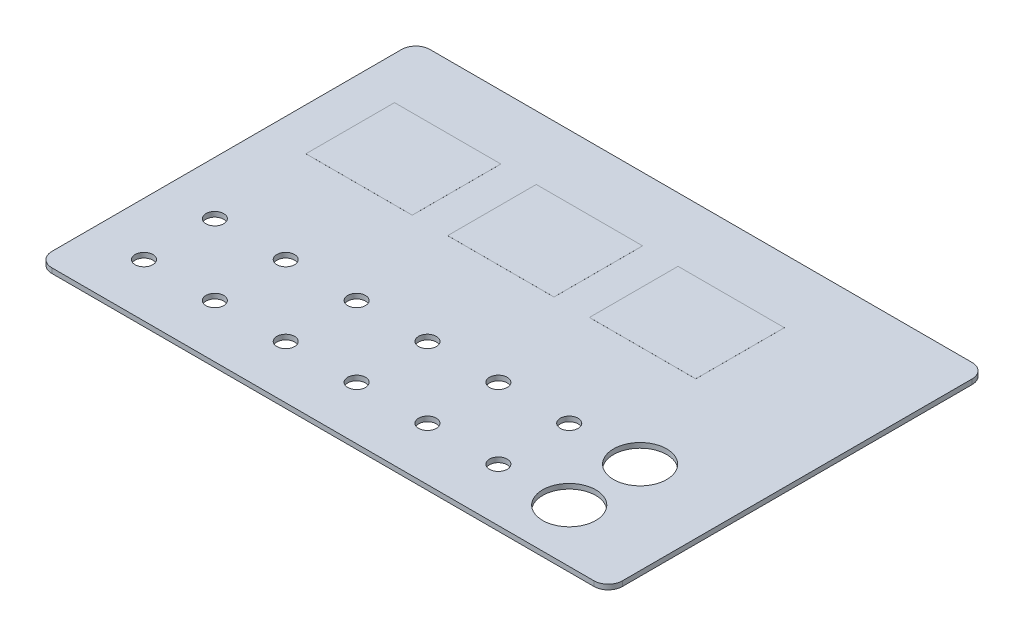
ISO-10303-21;
HEADER;
FILE_DESCRIPTION(('STEP AP214'),'2;1');
FILE_NAME('part.step','',(''),(''),'','','');
FILE_SCHEMA(('AUTOMOTIVE_DESIGN { 1 0 10303 214 1 1 1 1 }'));
ENDSEC;
DATA;
#1=APPLICATION_CONTEXT('core data for automotive mechanical design processes');
#2=APPLICATION_PROTOCOL_DEFINITION('international standard','automotive_design',2000,#1);
#3=PRODUCT_CONTEXT('',#1,'mechanical');
#4=PRODUCT('Part','Part','',(#3));
#5=PRODUCT_RELATED_PRODUCT_CATEGORY('part','',(#4));
#6=PRODUCT_DEFINITION_FORMATION('','',#4);
#7=PRODUCT_DEFINITION_CONTEXT('part definition',#1,'design');
#8=PRODUCT_DEFINITION('design','',#6,#7);
#9=PRODUCT_DEFINITION_SHAPE('','',#8);
#10=(LENGTH_UNIT() NAMED_UNIT(*) SI_UNIT(.MILLI.,.METRE.));
#11=(NAMED_UNIT(*) PLANE_ANGLE_UNIT() SI_UNIT($,.RADIAN.));
#12=(NAMED_UNIT(*) SI_UNIT($,.STERADIAN.) SOLID_ANGLE_UNIT());
#13=UNCERTAINTY_MEASURE_WITH_UNIT(LENGTH_MEASURE(1.E-05),#10,'distance_accuracy_value','');
#14=(GEOMETRIC_REPRESENTATION_CONTEXT(3) GLOBAL_UNCERTAINTY_ASSIGNED_CONTEXT((#13)) GLOBAL_UNIT_ASSIGNED_CONTEXT((#10,
#11,#12)) REPRESENTATION_CONTEXT('',''));
#15=CARTESIAN_POINT('',(0.,0.,0.));
#16=DIRECTION('',(0.,0.,1.));
#17=DIRECTION('',(1.,0.,0.));
#18=AXIS2_PLACEMENT_3D('',#15,#16,#17);
#19=CARTESIAN_POINT('',(0.,1.4,0.));
#20=DIRECTION('',(0.,1.,0.));
#21=DIRECTION('',(0.,0.,1.));
#22=AXIS2_PLACEMENT_3D('',#19,#20,#21);
#23=PLANE('',#22);
#24=DIRECTION('',(1.,0.,0.));
#25=VECTOR('',#24,1.);
#26=CARTESIAN_POINT('',(-22.7057496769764,1.4,-19.48512858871));
#27=LINE('',#26,#25);
#28=CARTESIAN_POINT('',(-22.7057496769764,1.4,-19.48512858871));
#29=VERTEX_POINT('',#28);
#30=CARTESIAN_POINT('',(7.29425032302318,1.4,-19.48512858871));
#31=VERTEX_POINT('',#30);
#32=EDGE_CURVE('E200',#29,#31,#27,.T.);
#33=ORIENTED_EDGE('',*,*,#32,.F.);
#34=DIRECTION('',(0.,0.,1.));
#35=VECTOR('',#34,1.);
#36=CARTESIAN_POINT('',(-22.7057496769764,1.4,-44.48512858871));
#37=LINE('',#36,#35);
#38=CARTESIAN_POINT('',(-22.7057496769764,1.4,-44.48512858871));
#39=VERTEX_POINT('',#38);
#40=EDGE_CURVE('E197',#39,#29,#37,.T.);
#41=ORIENTED_EDGE('',*,*,#40,.F.);
#42=DIRECTION('',(-1.,0.,0.));
#43=VECTOR('',#42,1.);
#44=CARTESIAN_POINT('',(-22.7057496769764,1.4,-44.48512858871));
#45=LINE('',#44,#43);
#46=CARTESIAN_POINT('',(7.29425032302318,1.4,-44.48512858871));
#47=VERTEX_POINT('',#46);
#48=EDGE_CURVE('E210',#47,#39,#45,.T.);
#49=ORIENTED_EDGE('',*,*,#48,.F.);
#50=DIRECTION('',(0.,0.,-1.));
#51=VECTOR('',#50,1.);
#52=CARTESIAN_POINT('',(7.29425032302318,1.4,-44.48512858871));
#53=LINE('',#52,#51);
#54=EDGE_CURVE('E218',#31,#47,#53,.T.);
#55=ORIENTED_EDGE('',*,*,#54,.F.);
#56=EDGE_LOOP('',(#33,#41,#49,#55));
#57=FACE_BOUND('',#56,.T.);
#58=DIRECTION('',(-1.,0.,0.));
#59=VECTOR('',#58,1.);
#60=CARTESIAN_POINT('',(-74.7057496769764,1.4,-62.48512858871));
#61=LINE('',#60,#59);
#62=CARTESIAN_POINT('',(82.2942503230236,1.4,-62.48512858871));
#63=VERTEX_POINT('',#62);
#64=CARTESIAN_POINT('',(-70.7057496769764,1.4,-62.48512858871));
#65=VERTEX_POINT('',#64);
#66=EDGE_CURVE('E353',#63,#65,#61,.T.);
#67=ORIENTED_EDGE('',*,*,#66,.T.);
#68=CARTESIAN_POINT('',(-70.7057496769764,1.4,-58.48512858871));
#69=DIRECTION('',(0.,1.,0.));
#70=DIRECTION('',(0.,0.,1.));
#71=AXIS2_PLACEMENT_3D('',#68,#69,#70);
#72=CIRCLE('',#71,4.);
#73=CARTESIAN_POINT('',(-74.7057496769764,1.4,-58.48512858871));
#74=VERTEX_POINT('',#73);
#75=EDGE_CURVE('E388',#65,#74,#72,.T.);
#76=ORIENTED_EDGE('',*,*,#75,.T.);
#77=DIRECTION('',(0.,0.,1.));
#78=VECTOR('',#77,1.);
#79=CARTESIAN_POINT('',(-74.7057496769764,1.4,-62.48512858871));
#80=LINE('',#79,#78);
#81=CARTESIAN_POINT('',(-74.7057496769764,1.4,40.21487141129));
#82=VERTEX_POINT('',#81);
#83=EDGE_CURVE('E345',#74,#82,#80,.T.);
#84=ORIENTED_EDGE('',*,*,#83,.T.);
#85=CARTESIAN_POINT('',(-70.7057496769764,1.4,40.21487141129));
#86=DIRECTION('',(0.,1.,0.));
#87=DIRECTION('',(0.,0.,1.));
#88=AXIS2_PLACEMENT_3D('',#85,#86,#87);
#89=CIRCLE('',#88,4.);
#90=CARTESIAN_POINT('',(-70.7057496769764,1.4,44.21487141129));
#91=VERTEX_POINT('',#90);
#92=EDGE_CURVE('E386',#82,#91,#89,.T.);
#93=ORIENTED_EDGE('',*,*,#92,.T.);
#94=DIRECTION('',(1.,0.,0.));
#95=VECTOR('',#94,1.);
#96=CARTESIAN_POINT('',(-74.7057496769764,1.4,44.21487141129));
#97=LINE('',#96,#95);
#98=CARTESIAN_POINT('',(82.2942503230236,1.4,44.21487141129));
#99=VERTEX_POINT('',#98);
#100=EDGE_CURVE('E348',#91,#99,#97,.T.);
#101=ORIENTED_EDGE('',*,*,#100,.T.);
#102=CARTESIAN_POINT('',(82.2942503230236,1.4,40.21487141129));
#103=DIRECTION('',(0.,1.,0.));
#104=DIRECTION('',(0.,0.,1.));
#105=AXIS2_PLACEMENT_3D('',#102,#103,#104);
#106=CIRCLE('',#105,4.);
#107=CARTESIAN_POINT('',(86.2942503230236,1.4,40.21487141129));
#108=VERTEX_POINT('',#107);
#109=EDGE_CURVE('E55',#99,#108,#106,.T.);
#110=ORIENTED_EDGE('',*,*,#109,.T.);
#111=DIRECTION('',(0.,0.,-1.));
#112=VECTOR('',#111,1.);
#113=CARTESIAN_POINT('',(86.2942503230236,1.4,-62.48512858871));
#114=LINE('',#113,#112);
#115=CARTESIAN_POINT('',(86.2942503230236,1.4,-58.48512858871));
#116=VERTEX_POINT('',#115);
#117=EDGE_CURVE('E351',#108,#116,#114,.T.);
#118=ORIENTED_EDGE('',*,*,#117,.T.);
#119=CARTESIAN_POINT('',(82.2942503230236,1.4,-58.48512858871));
#120=DIRECTION('',(0.,1.,0.));
#121=DIRECTION('',(0.,0.,1.));
#122=AXIS2_PLACEMENT_3D('',#119,#120,#121);
#123=CIRCLE('',#122,4.);
#124=EDGE_CURVE('E384',#116,#63,#123,.T.);
#125=ORIENTED_EDGE('',*,*,#124,.T.);
#126=EDGE_LOOP('',(#67,#76,#84,#93,#101,#110,#118,#125));
#127=FACE_BOUND('',#126,.T.);
#128=CARTESIAN_POINT('',(-59.7057496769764,1.4,29.21487141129));
#129=DIRECTION('',(0.,1.,0.));
#130=DIRECTION('',(0.,0.,1.));
#131=AXIS2_PLACEMENT_3D('',#128,#129,#130);
#132=CIRCLE('',#131,2.5);
#133=CARTESIAN_POINT('',(-59.7057496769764,1.4,31.71487141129));
#134=VERTEX_POINT('',#133);
#135=EDGE_CURVE('E336',#134,#134,#132,.T.);
#136=ORIENTED_EDGE('',*,*,#135,.F.);
#137=EDGE_LOOP('',(#136));
#138=FACE_BOUND('',#137,.T.);
#139=CARTESIAN_POINT('',(-59.7057496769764,1.4,9.21487141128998));
#140=DIRECTION('',(0.,1.,0.));
#141=DIRECTION('',(0.,0.,1.));
#142=AXIS2_PLACEMENT_3D('',#139,#140,#141);
#143=CIRCLE('',#142,2.5);
#144=CARTESIAN_POINT('',(-59.7057496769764,1.4,11.71487141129));
#145=VERTEX_POINT('',#144);
#146=EDGE_CURVE('E330',#145,#145,#143,.T.);
#147=ORIENTED_EDGE('',*,*,#146,.F.);
#148=EDGE_LOOP('',(#147));
#149=FACE_BOUND('',#148,.T.);
#150=CARTESIAN_POINT('',(-39.7057496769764,1.4,29.21487141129));
#151=DIRECTION('',(0.,1.,0.));
#152=DIRECTION('',(0.,0.,1.));
#153=AXIS2_PLACEMENT_3D('',#150,#151,#152);
#154=CIRCLE('',#153,2.5);
#155=CARTESIAN_POINT('',(-39.7057496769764,1.4,31.71487141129));
#156=VERTEX_POINT('',#155);
#157=EDGE_CURVE('E324',#156,#156,#154,.T.);
#158=ORIENTED_EDGE('',*,*,#157,.F.);
#159=EDGE_LOOP('',(#158));
#160=FACE_BOUND('',#159,.T.);
#161=CARTESIAN_POINT('',(-39.7057496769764,1.4,9.21487141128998));
#162=DIRECTION('',(0.,1.,0.));
#163=DIRECTION('',(0.,0.,1.));
#164=AXIS2_PLACEMENT_3D('',#161,#162,#163);
#165=CIRCLE('',#164,2.5);
#166=CARTESIAN_POINT('',(-39.7057496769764,1.4,11.71487141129));
#167=VERTEX_POINT('',#166);
#168=EDGE_CURVE('E318',#167,#167,#165,.T.);
#169=ORIENTED_EDGE('',*,*,#168,.F.);
#170=EDGE_LOOP('',(#169));
#171=FACE_BOUND('',#170,.T.);
#172=CARTESIAN_POINT('',(-19.7057496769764,1.4,9.21487141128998));
#173=DIRECTION('',(0.,1.,0.));
#174=DIRECTION('',(0.,0.,1.));
#175=AXIS2_PLACEMENT_3D('',#172,#173,#174);
#176=CIRCLE('',#175,2.5);
#177=CARTESIAN_POINT('',(-19.7057496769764,1.4,11.71487141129));
#178=VERTEX_POINT('',#177);
#179=EDGE_CURVE('E312',#178,#178,#176,.T.);
#180=ORIENTED_EDGE('',*,*,#179,.F.);
#181=EDGE_LOOP('',(#180));
#182=FACE_BOUND('',#181,.T.);
#183=CARTESIAN_POINT('',(-19.7057496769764,1.4,29.21487141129));
#184=DIRECTION('',(0.,1.,0.));
#185=DIRECTION('',(0.,0.,1.));
#186=AXIS2_PLACEMENT_3D('',#183,#184,#185);
#187=CIRCLE('',#186,2.5);
#188=CARTESIAN_POINT('',(-19.7057496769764,1.4,31.71487141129));
#189=VERTEX_POINT('',#188);
#190=EDGE_CURVE('E306',#189,#189,#187,.T.);
#191=ORIENTED_EDGE('',*,*,#190,.F.);
#192=EDGE_LOOP('',(#191));
#193=FACE_BOUND('',#192,.T.);
#194=CARTESIAN_POINT('',(0.294250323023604,1.4,29.21487141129));
#195=DIRECTION('',(0.,1.,0.));
#196=DIRECTION('',(0.,0.,1.));
#197=AXIS2_PLACEMENT_3D('',#194,#195,#196);
#198=CIRCLE('',#197,2.5);
#199=CARTESIAN_POINT('',(0.294250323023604,1.4,31.71487141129));
#200=VERTEX_POINT('',#199);
#201=EDGE_CURVE('E300',#200,#200,#198,.T.);
#202=ORIENTED_EDGE('',*,*,#201,.F.);
#203=EDGE_LOOP('',(#202));
#204=FACE_BOUND('',#203,.T.);
#205=CARTESIAN_POINT('',(0.29425032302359,1.4,9.21487141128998));
#206=DIRECTION('',(0.,1.,0.));
#207=DIRECTION('',(0.,0.,1.));
#208=AXIS2_PLACEMENT_3D('',#205,#206,#207);
#209=CIRCLE('',#208,2.50000000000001);
#210=CARTESIAN_POINT('',(0.29425032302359,1.4,11.71487141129));
#211=VERTEX_POINT('',#210);
#212=EDGE_CURVE('E294',#211,#211,#209,.T.);
#213=ORIENTED_EDGE('',*,*,#212,.F.);
#214=EDGE_LOOP('',(#213));
#215=FACE_BOUND('',#214,.T.);
#216=CARTESIAN_POINT('',(20.2942503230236,1.4,29.21487141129));
#217=DIRECTION('',(0.,1.,0.));
#218=DIRECTION('',(0.,0.,1.));
#219=AXIS2_PLACEMENT_3D('',#216,#217,#218);
#220=CIRCLE('',#219,2.50000000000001);
#221=CARTESIAN_POINT('',(20.2942503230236,1.4,31.71487141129));
#222=VERTEX_POINT('',#221);
#223=EDGE_CURVE('E288',#222,#222,#220,.T.);
#224=ORIENTED_EDGE('',*,*,#223,.F.);
#225=EDGE_LOOP('',(#224));
#226=FACE_BOUND('',#225,.T.);
#227=CARTESIAN_POINT('',(20.2942503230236,1.4,9.21487141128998));
#228=DIRECTION('',(0.,1.,0.));
#229=DIRECTION('',(0.,0.,1.));
#230=AXIS2_PLACEMENT_3D('',#227,#228,#229);
#231=CIRCLE('',#230,2.5);
#232=CARTESIAN_POINT('',(20.2942503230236,1.4,11.71487141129));
#233=VERTEX_POINT('',#232);
#234=EDGE_CURVE('E282',#233,#233,#231,.T.);
#235=ORIENTED_EDGE('',*,*,#234,.F.);
#236=EDGE_LOOP('',(#235));
#237=FACE_BOUND('',#236,.T.);
#238=CARTESIAN_POINT('',(40.2942503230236,1.4,29.21487141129));
#239=DIRECTION('',(0.,1.,0.));
#240=DIRECTION('',(0.,0.,1.));
#241=AXIS2_PLACEMENT_3D('',#238,#239,#240);
#242=CIRCLE('',#241,2.5);
#243=CARTESIAN_POINT('',(40.2942503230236,1.4,31.71487141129));
#244=VERTEX_POINT('',#243);
#245=EDGE_CURVE('E276',#244,#244,#242,.T.);
#246=ORIENTED_EDGE('',*,*,#245,.F.);
#247=EDGE_LOOP('',(#246));
#248=FACE_BOUND('',#247,.T.);
#249=CARTESIAN_POINT('',(40.2942503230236,1.4,9.21487141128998));
#250=DIRECTION('',(0.,1.,0.));
#251=DIRECTION('',(0.,0.,1.));
#252=AXIS2_PLACEMENT_3D('',#249,#250,#251);
#253=CIRCLE('',#252,2.50000000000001);
#254=CARTESIAN_POINT('',(40.2942503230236,1.4,11.71487141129));
#255=VERTEX_POINT('',#254);
#256=EDGE_CURVE('E270',#255,#255,#253,.T.);
#257=ORIENTED_EDGE('',*,*,#256,.F.);
#258=EDGE_LOOP('',(#257));
#259=FACE_BOUND('',#258,.T.);
#260=CARTESIAN_POINT('',(60.2942503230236,1.4,29.21487141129));
#261=DIRECTION('',(0.,1.,0.));
#262=DIRECTION('',(0.,0.,1.));
#263=AXIS2_PLACEMENT_3D('',#260,#261,#262);
#264=CIRCLE('',#263,7.50000000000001);
#265=CARTESIAN_POINT('',(60.2942503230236,1.4,36.71487141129));
#266=VERTEX_POINT('',#265);
#267=EDGE_CURVE('E264',#266,#266,#264,.T.);
#268=ORIENTED_EDGE('',*,*,#267,.F.);
#269=EDGE_LOOP('',(#268));
#270=FACE_BOUND('',#269,.T.);
#271=CARTESIAN_POINT('',(60.2942503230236,1.4,9.21487141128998));
#272=DIRECTION('',(0.,1.,0.));
#273=DIRECTION('',(0.,0.,1.));
#274=AXIS2_PLACEMENT_3D('',#271,#272,#273);
#275=CIRCLE('',#274,7.50000000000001);
#276=CARTESIAN_POINT('',(60.2942503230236,1.4,16.71487141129));
#277=VERTEX_POINT('',#276);
#278=EDGE_CURVE('E260',#277,#277,#275,.T.);
#279=ORIENTED_EDGE('',*,*,#278,.F.);
#280=EDGE_LOOP('',(#279));
#281=FACE_BOUND('',#280,.T.);
#282=DIRECTION('',(1.,0.,0.));
#283=VECTOR('',#282,1.);
#284=CARTESIAN_POINT('',(-62.7057496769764,1.4,-19.48512858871));
#285=LINE('',#284,#283);
#286=CARTESIAN_POINT('',(-62.7057496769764,1.4,-19.48512858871));
#287=VERTEX_POINT('',#286);
#288=CARTESIAN_POINT('',(-32.7057496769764,1.4,-19.48512858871));
#289=VERTEX_POINT('',#288);
#290=EDGE_CURVE('E245',#287,#289,#285,.T.);
#291=ORIENTED_EDGE('',*,*,#290,.F.);
#292=DIRECTION('',(0.,0.,1.));
#293=VECTOR('',#292,1.);
#294=CARTESIAN_POINT('',(-62.7057496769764,1.4,-44.48512858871));
#295=LINE('',#294,#293);
#296=CARTESIAN_POINT('',(-62.7057496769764,1.4,-44.48512858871));
#297=VERTEX_POINT('',#296);
#298=EDGE_CURVE('E231',#297,#287,#295,.T.);
#299=ORIENTED_EDGE('',*,*,#298,.F.);
#300=DIRECTION('',(-1.,0.,0.));
#301=VECTOR('',#300,1.);
#302=CARTESIAN_POINT('',(-62.7057496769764,1.4,-44.48512858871));
#303=LINE('',#302,#301);
#304=CARTESIAN_POINT('',(-32.7057496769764,1.4,-44.48512858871));
#305=VERTEX_POINT('',#304);
#306=EDGE_CURVE('E236',#305,#297,#303,.T.);
#307=ORIENTED_EDGE('',*,*,#306,.F.);
#308=DIRECTION('',(0.,0.,-1.));
#309=VECTOR('',#308,1.);
#310=CARTESIAN_POINT('',(-32.7057496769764,1.4,-44.48512858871));
#311=LINE('',#310,#309);
#312=EDGE_CURVE('E247',#289,#305,#311,.T.);
#313=ORIENTED_EDGE('',*,*,#312,.F.);
#314=EDGE_LOOP('',(#291,#299,#307,#313));
#315=FACE_BOUND('',#314,.T.);
#316=DIRECTION('',(1.,0.,0.));
#317=VECTOR('',#316,1.);
#318=CARTESIAN_POINT('',(17.2942503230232,1.4,-19.48512858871));
#319=LINE('',#318,#317);
#320=CARTESIAN_POINT('',(17.2942503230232,1.4,-19.48512858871));
#321=VERTEX_POINT('',#320);
#322=CARTESIAN_POINT('',(47.2942503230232,1.4,-19.48512858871));
#323=VERTEX_POINT('',#322);
#324=EDGE_CURVE('E829',#321,#323,#319,.T.);
#325=ORIENTED_EDGE('',*,*,#324,.F.);
#326=DIRECTION('',(0.,0.,1.));
#327=VECTOR('',#326,1.);
#328=CARTESIAN_POINT('',(17.2942503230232,1.4,-44.48512858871));
#329=LINE('',#328,#327);
#330=CARTESIAN_POINT('',(17.2942503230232,1.4,-44.48512858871));
#331=VERTEX_POINT('',#330);
#332=EDGE_CURVE('E195',#331,#321,#329,.T.);
#333=ORIENTED_EDGE('',*,*,#332,.F.);
#334=DIRECTION('',(-1.,0.,0.));
#335=VECTOR('',#334,1.);
#336=CARTESIAN_POINT('',(17.2942503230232,1.4,-44.48512858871));
#337=LINE('',#336,#335);
#338=CARTESIAN_POINT('',(47.2942503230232,1.4,-44.48512858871));
#339=VERTEX_POINT('',#338);
#340=EDGE_CURVE('E191',#339,#331,#337,.T.);
#341=ORIENTED_EDGE('',*,*,#340,.F.);
#342=DIRECTION('',(0.,0.,-1.));
#343=VECTOR('',#342,1.);
#344=CARTESIAN_POINT('',(47.2942503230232,1.4,-44.48512858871));
#345=LINE('',#344,#343);
#346=EDGE_CURVE('E832',#323,#339,#345,.T.);
#347=ORIENTED_EDGE('',*,*,#346,.F.);
#348=EDGE_LOOP('',(#325,#333,#341,#347));
#349=FACE_BOUND('',#348,.T.);
#350=ADVANCED_FACE('F35',(#57,#127,#138,#149,#160,#171,#182,#193,#204,#215,#226,#237,#248,#259,
#270,#281,#315,#349),#23,.T.);
#351=CARTESIAN_POINT('',(-74.7057496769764,1.4,-62.48512858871));
#352=DIRECTION('',(1.,0.,0.));
#353=DIRECTION('',(0.,0.,-1.));
#354=AXIS2_PLACEMENT_3D('',#351,#352,#353);
#355=PLANE('',#354);
#356=ORIENTED_EDGE('',*,*,#83,.F.);
#357=DIRECTION('',(0.,-1.,0.));
#358=VECTOR('',#357,1.);
#359=CARTESIAN_POINT('',(-74.7057496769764,1.4,-58.48512858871));
#360=LINE('',#359,#358);
#361=CARTESIAN_POINT('',(-74.7057496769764,0.,-58.48512858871));
#362=VERTEX_POINT('',#361);
#363=EDGE_CURVE('E367',#74,#362,#360,.T.);
#364=ORIENTED_EDGE('',*,*,#363,.T.);
#365=DIRECTION('',(0.,0.,1.));
#366=VECTOR('',#365,1.);
#367=CARTESIAN_POINT('',(-74.7057496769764,0.,-62.48512858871));
#368=LINE('',#367,#366);
#369=CARTESIAN_POINT('',(-74.7057496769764,0.,40.21487141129));
#370=VERTEX_POINT('',#369);
#371=EDGE_CURVE('E342',#362,#370,#368,.T.);
#372=ORIENTED_EDGE('',*,*,#371,.T.);
#373=DIRECTION('',(0.,-1.,0.));
#374=VECTOR('',#373,1.);
#375=CARTESIAN_POINT('',(-74.7057496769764,1.4,40.21487141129));
#376=LINE('',#375,#374);
#377=EDGE_CURVE('E356',#370,#82,#376,.F.);
#378=ORIENTED_EDGE('',*,*,#377,.T.);
#379=EDGE_LOOP('',(#356,#364,#372,#378));
#380=FACE_BOUND('',#379,.T.);
#381=ADVANCED_FACE('F419',(#380),#355,.F.);
#382=CARTESIAN_POINT('',(-74.7057496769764,1.4,44.21487141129));
#383=DIRECTION('',(0.,0.,-1.));
#384=DIRECTION('',(-1.,0.,0.));
#385=AXIS2_PLACEMENT_3D('',#382,#383,#384);
#386=PLANE('',#385);
#387=ORIENTED_EDGE('',*,*,#100,.F.);
#388=DIRECTION('',(0.,-1.,0.));
#389=VECTOR('',#388,1.);
#390=CARTESIAN_POINT('',(-70.7057496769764,1.4,44.21487141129));
#391=LINE('',#390,#389);
#392=CARTESIAN_POINT('',(-70.7057496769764,0.,44.21487141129));
#393=VERTEX_POINT('',#392);
#394=EDGE_CURVE('E392',#91,#393,#391,.T.);
#395=ORIENTED_EDGE('',*,*,#394,.T.);
#396=DIRECTION('',(1.,0.,0.));
#397=VECTOR('',#396,1.);
#398=CARTESIAN_POINT('',(-74.7057496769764,0.,44.21487141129));
#399=LINE('',#398,#397);
#400=CARTESIAN_POINT('',(82.2942503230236,0.,44.21487141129));
#401=VERTEX_POINT('',#400);
#402=EDGE_CURVE('E359',#393,#401,#399,.T.);
#403=ORIENTED_EDGE('',*,*,#402,.T.);
#404=DIRECTION('',(0.,-1.,0.));
#405=VECTOR('',#404,1.);
#406=CARTESIAN_POINT('',(82.2942503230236,1.4,44.21487141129));
#407=LINE('',#406,#405);
#408=EDGE_CURVE('E390',#401,#99,#407,.F.);
#409=ORIENTED_EDGE('',*,*,#408,.T.);
#410=EDGE_LOOP('',(#387,#395,#403,#409));
#411=FACE_BOUND('',#410,.T.);
#412=ADVANCED_FACE('F427',(#411),#386,.F.);
#413=CARTESIAN_POINT('',(86.2942503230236,1.4,-62.48512858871));
#414=DIRECTION('',(-1.,0.,0.));
#415=DIRECTION('',(0.,0.,1.));
#416=AXIS2_PLACEMENT_3D('',#413,#414,#415);
#417=PLANE('',#416);
#418=DIRECTION('',(0.,0.,-1.));
#419=VECTOR('',#418,1.);
#420=CARTESIAN_POINT('',(86.2942503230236,0.,-62.48512858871));
#421=LINE('',#420,#419);
#422=CARTESIAN_POINT('',(86.2942503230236,0.,40.21487141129));
#423=VERTEX_POINT('',#422);
#424=CARTESIAN_POINT('',(86.2942503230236,0.,-58.48512858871));
#425=VERTEX_POINT('',#424);
#426=EDGE_CURVE('E362',#423,#425,#421,.T.);
#427=ORIENTED_EDGE('',*,*,#426,.T.);
#428=DIRECTION('',(0.,-1.,0.));
#429=VECTOR('',#428,1.);
#430=CARTESIAN_POINT('',(86.2942503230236,1.4,-58.48512858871));
#431=LINE('',#430,#429);
#432=EDGE_CURVE('E11',#425,#116,#431,.F.);
#433=ORIENTED_EDGE('',*,*,#432,.T.);
#434=ORIENTED_EDGE('',*,*,#117,.F.);
#435=DIRECTION('',(0.,-1.,0.));
#436=VECTOR('',#435,1.);
#437=CARTESIAN_POINT('',(86.2942503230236,1.4,40.21487141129));
#438=LINE('',#437,#436);
#439=EDGE_CURVE('E43',#108,#423,#438,.T.);
#440=ORIENTED_EDGE('',*,*,#439,.T.);
#441=EDGE_LOOP('',(#427,#433,#434,#440));
#442=FACE_BOUND('',#441,.T.);
#443=ADVANCED_FACE('F397',(#442),#417,.F.);
#444=CARTESIAN_POINT('',(-74.7057496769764,1.4,-62.48512858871));
#445=DIRECTION('',(0.,0.,1.));
#446=DIRECTION('',(1.,0.,0.));
#447=AXIS2_PLACEMENT_3D('',#444,#445,#446);
#448=PLANE('',#447);
#449=DIRECTION('',(-1.,0.,0.));
#450=VECTOR('',#449,1.);
#451=CARTESIAN_POINT('',(-74.7057496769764,0.,-62.48512858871));
#452=LINE('',#451,#450);
#453=CARTESIAN_POINT('',(82.2942503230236,0.,-62.48512858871));
#454=VERTEX_POINT('',#453);
#455=CARTESIAN_POINT('',(-70.7057496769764,0.,-62.48512858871));
#456=VERTEX_POINT('',#455);
#457=EDGE_CURVE('E349',#454,#456,#452,.T.);
#458=ORIENTED_EDGE('',*,*,#457,.T.);
#459=DIRECTION('',(0.,-1.,0.));
#460=VECTOR('',#459,1.);
#461=CARTESIAN_POINT('',(-70.7057496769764,1.4,-62.48512858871));
#462=LINE('',#461,#460);
#463=EDGE_CURVE('E381',#456,#65,#462,.F.);
#464=ORIENTED_EDGE('',*,*,#463,.T.);
#465=ORIENTED_EDGE('',*,*,#66,.F.);
#466=DIRECTION('',(0.,-1.,0.));
#467=VECTOR('',#466,1.);
#468=CARTESIAN_POINT('',(82.2942503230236,1.4,-62.48512858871));
#469=LINE('',#468,#467);
#470=EDGE_CURVE('E378',#63,#454,#469,.T.);
#471=ORIENTED_EDGE('',*,*,#470,.T.);
#472=EDGE_LOOP('',(#458,#464,#465,#471));
#473=FACE_BOUND('',#472,.T.);
#474=ADVANCED_FACE('F410',(#473),#448,.F.);
#475=CARTESIAN_POINT('',(0.,0.,0.));
#476=DIRECTION('',(0.,1.,0.));
#477=DIRECTION('',(0.,0.,1.));
#478=AXIS2_PLACEMENT_3D('',#475,#476,#477);
#479=PLANE('',#478);
#480=CARTESIAN_POINT('',(60.2942503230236,0.,9.21487141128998));
#481=DIRECTION('',(0.,1.,0.));
#482=DIRECTION('',(0.,0.,1.));
#483=AXIS2_PLACEMENT_3D('',#480,#481,#482);
#484=CIRCLE('',#483,7.50000000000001);
#485=CARTESIAN_POINT('',(60.2942503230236,0.,16.71487141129));
#486=VERTEX_POINT('',#485);
#487=EDGE_CURVE('E261',#486,#486,#484,.T.);
#488=ORIENTED_EDGE('',*,*,#487,.T.);
#489=EDGE_LOOP('',(#488));
#490=FACE_BOUND('',#489,.T.);
#491=CARTESIAN_POINT('',(60.2942503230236,0.,29.21487141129));
#492=DIRECTION('',(0.,1.,0.));
#493=DIRECTION('',(0.,0.,1.));
#494=AXIS2_PLACEMENT_3D('',#491,#492,#493);
#495=CIRCLE('',#494,7.50000000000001);
#496=CARTESIAN_POINT('',(60.2942503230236,0.,36.71487141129));
#497=VERTEX_POINT('',#496);
#498=EDGE_CURVE('E267',#497,#497,#495,.T.);
#499=ORIENTED_EDGE('',*,*,#498,.T.);
#500=EDGE_LOOP('',(#499));
#501=FACE_BOUND('',#500,.T.);
#502=CARTESIAN_POINT('',(40.2942503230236,0.,9.21487141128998));
#503=DIRECTION('',(0.,1.,0.));
#504=DIRECTION('',(0.,0.,1.));
#505=AXIS2_PLACEMENT_3D('',#502,#503,#504);
#506=CIRCLE('',#505,2.50000000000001);
#507=CARTESIAN_POINT('',(40.2942503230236,0.,11.71487141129));
#508=VERTEX_POINT('',#507);
#509=EDGE_CURVE('E273',#508,#508,#506,.T.);
#510=ORIENTED_EDGE('',*,*,#509,.T.);
#511=EDGE_LOOP('',(#510));
#512=FACE_BOUND('',#511,.T.);
#513=CARTESIAN_POINT('',(40.2942503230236,0.,29.21487141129));
#514=DIRECTION('',(0.,1.,0.));
#515=DIRECTION('',(0.,0.,1.));
#516=AXIS2_PLACEMENT_3D('',#513,#514,#515);
#517=CIRCLE('',#516,2.5);
#518=CARTESIAN_POINT('',(40.2942503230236,0.,31.71487141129));
#519=VERTEX_POINT('',#518);
#520=EDGE_CURVE('E279',#519,#519,#517,.T.);
#521=ORIENTED_EDGE('',*,*,#520,.T.);
#522=EDGE_LOOP('',(#521));
#523=FACE_BOUND('',#522,.T.);
#524=CARTESIAN_POINT('',(20.2942503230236,0.,9.21487141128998));
#525=DIRECTION('',(0.,1.,0.));
#526=DIRECTION('',(0.,0.,1.));
#527=AXIS2_PLACEMENT_3D('',#524,#525,#526);
#528=CIRCLE('',#527,2.5);
#529=CARTESIAN_POINT('',(20.2942503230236,0.,11.71487141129));
#530=VERTEX_POINT('',#529);
#531=EDGE_CURVE('E285',#530,#530,#528,.T.);
#532=ORIENTED_EDGE('',*,*,#531,.T.);
#533=EDGE_LOOP('',(#532));
#534=FACE_BOUND('',#533,.T.);
#535=CARTESIAN_POINT('',(20.2942503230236,0.,29.21487141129));
#536=DIRECTION('',(0.,1.,0.));
#537=DIRECTION('',(0.,0.,1.));
#538=AXIS2_PLACEMENT_3D('',#535,#536,#537);
#539=CIRCLE('',#538,2.50000000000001);
#540=CARTESIAN_POINT('',(20.2942503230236,0.,31.71487141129));
#541=VERTEX_POINT('',#540);
#542=EDGE_CURVE('E291',#541,#541,#539,.T.);
#543=ORIENTED_EDGE('',*,*,#542,.T.);
#544=EDGE_LOOP('',(#543));
#545=FACE_BOUND('',#544,.T.);
#546=CARTESIAN_POINT('',(0.29425032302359,0.,9.21487141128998));
#547=DIRECTION('',(0.,1.,0.));
#548=DIRECTION('',(0.,0.,1.));
#549=AXIS2_PLACEMENT_3D('',#546,#547,#548);
#550=CIRCLE('',#549,2.50000000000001);
#551=CARTESIAN_POINT('',(0.29425032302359,0.,11.71487141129));
#552=VERTEX_POINT('',#551);
#553=EDGE_CURVE('E297',#552,#552,#550,.T.);
#554=ORIENTED_EDGE('',*,*,#553,.T.);
#555=EDGE_LOOP('',(#554));
#556=FACE_BOUND('',#555,.T.);
#557=CARTESIAN_POINT('',(0.294250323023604,0.,29.21487141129));
#558=DIRECTION('',(0.,1.,0.));
#559=DIRECTION('',(0.,0.,1.));
#560=AXIS2_PLACEMENT_3D('',#557,#558,#559);
#561=CIRCLE('',#560,2.5);
#562=CARTESIAN_POINT('',(0.294250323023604,0.,31.71487141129));
#563=VERTEX_POINT('',#562);
#564=EDGE_CURVE('E303',#563,#563,#561,.T.);
#565=ORIENTED_EDGE('',*,*,#564,.T.);
#566=EDGE_LOOP('',(#565));
#567=FACE_BOUND('',#566,.T.);
#568=CARTESIAN_POINT('',(-19.7057496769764,0.,29.21487141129));
#569=DIRECTION('',(0.,1.,0.));
#570=DIRECTION('',(0.,0.,1.));
#571=AXIS2_PLACEMENT_3D('',#568,#569,#570);
#572=CIRCLE('',#571,2.5);
#573=CARTESIAN_POINT('',(-19.7057496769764,0.,31.71487141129));
#574=VERTEX_POINT('',#573);
#575=EDGE_CURVE('E309',#574,#574,#572,.T.);
#576=ORIENTED_EDGE('',*,*,#575,.T.);
#577=EDGE_LOOP('',(#576));
#578=FACE_BOUND('',#577,.T.);
#579=CARTESIAN_POINT('',(-19.7057496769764,0.,9.21487141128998));
#580=DIRECTION('',(0.,1.,0.));
#581=DIRECTION('',(0.,0.,1.));
#582=AXIS2_PLACEMENT_3D('',#579,#580,#581);
#583=CIRCLE('',#582,2.5);
#584=CARTESIAN_POINT('',(-19.7057496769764,0.,11.71487141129));
#585=VERTEX_POINT('',#584);
#586=EDGE_CURVE('E315',#585,#585,#583,.T.);
#587=ORIENTED_EDGE('',*,*,#586,.T.);
#588=EDGE_LOOP('',(#587));
#589=FACE_BOUND('',#588,.T.);
#590=CARTESIAN_POINT('',(-39.7057496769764,0.,9.21487141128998));
#591=DIRECTION('',(0.,1.,0.));
#592=DIRECTION('',(0.,0.,1.));
#593=AXIS2_PLACEMENT_3D('',#590,#591,#592);
#594=CIRCLE('',#593,2.5);
#595=CARTESIAN_POINT('',(-39.7057496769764,0.,11.71487141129));
#596=VERTEX_POINT('',#595);
#597=EDGE_CURVE('E321',#596,#596,#594,.T.);
#598=ORIENTED_EDGE('',*,*,#597,.T.);
#599=EDGE_LOOP('',(#598));
#600=FACE_BOUND('',#599,.T.);
#601=CARTESIAN_POINT('',(-39.7057496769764,0.,29.21487141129));
#602=DIRECTION('',(0.,1.,0.));
#603=DIRECTION('',(0.,0.,1.));
#604=AXIS2_PLACEMENT_3D('',#601,#602,#603);
#605=CIRCLE('',#604,2.5);
#606=CARTESIAN_POINT('',(-39.7057496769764,0.,31.71487141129));
#607=VERTEX_POINT('',#606);
#608=EDGE_CURVE('E327',#607,#607,#605,.T.);
#609=ORIENTED_EDGE('',*,*,#608,.T.);
#610=EDGE_LOOP('',(#609));
#611=FACE_BOUND('',#610,.T.);
#612=CARTESIAN_POINT('',(-59.7057496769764,0.,9.21487141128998));
#613=DIRECTION('',(0.,1.,0.));
#614=DIRECTION('',(0.,0.,1.));
#615=AXIS2_PLACEMENT_3D('',#612,#613,#614);
#616=CIRCLE('',#615,2.5);
#617=CARTESIAN_POINT('',(-59.7057496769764,0.,11.71487141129));
#618=VERTEX_POINT('',#617);
#619=EDGE_CURVE('E333',#618,#618,#616,.T.);
#620=ORIENTED_EDGE('',*,*,#619,.T.);
#621=EDGE_LOOP('',(#620));
#622=FACE_BOUND('',#621,.T.);
#623=CARTESIAN_POINT('',(-59.7057496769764,0.,29.21487141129));
#624=DIRECTION('',(0.,1.,0.));
#625=DIRECTION('',(0.,0.,1.));
#626=AXIS2_PLACEMENT_3D('',#623,#624,#625);
#627=CIRCLE('',#626,2.5);
#628=CARTESIAN_POINT('',(-59.7057496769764,0.,31.71487141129));
#629=VERTEX_POINT('',#628);
#630=EDGE_CURVE('E339',#629,#629,#627,.T.);
#631=ORIENTED_EDGE('',*,*,#630,.T.);
#632=EDGE_LOOP('',(#631));
#633=FACE_BOUND('',#632,.T.);
#634=ORIENTED_EDGE('',*,*,#371,.F.);
#635=CARTESIAN_POINT('',(-70.7057496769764,0.,-58.48512858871));
#636=DIRECTION('',(0.,1.,0.));
#637=DIRECTION('',(0.,0.,1.));
#638=AXIS2_PLACEMENT_3D('',#635,#636,#637);
#639=CIRCLE('',#638,4.);
#640=EDGE_CURVE('E376',#362,#456,#639,.F.);
#641=ORIENTED_EDGE('',*,*,#640,.T.);
#642=ORIENTED_EDGE('',*,*,#457,.F.);
#643=CARTESIAN_POINT('',(82.2942503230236,0.,-58.48512858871));
#644=DIRECTION('',(0.,1.,0.));
#645=DIRECTION('',(0.,0.,1.));
#646=AXIS2_PLACEMENT_3D('',#643,#644,#645);
#647=CIRCLE('',#646,4.);
#648=EDGE_CURVE('E372',#454,#425,#647,.F.);
#649=ORIENTED_EDGE('',*,*,#648,.T.);
#650=ORIENTED_EDGE('',*,*,#426,.F.);
#651=CARTESIAN_POINT('',(82.2942503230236,0.,40.21487141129));
#652=DIRECTION('',(0.,1.,0.));
#653=DIRECTION('',(0.,0.,1.));
#654=AXIS2_PLACEMENT_3D('',#651,#652,#653);
#655=CIRCLE('',#654,4.);
#656=EDGE_CURVE('E370',#423,#401,#655,.F.);
#657=ORIENTED_EDGE('',*,*,#656,.T.);
#658=ORIENTED_EDGE('',*,*,#402,.F.);
#659=CARTESIAN_POINT('',(-70.7057496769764,0.,40.21487141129));
#660=DIRECTION('',(0.,1.,0.));
#661=DIRECTION('',(0.,0.,1.));
#662=AXIS2_PLACEMENT_3D('',#659,#660,#661);
#663=CIRCLE('',#662,4.);
#664=EDGE_CURVE('E374',#393,#370,#663,.F.);
#665=ORIENTED_EDGE('',*,*,#664,.T.);
#666=EDGE_LOOP('',(#634,#641,#642,#649,#650,#657,#658,#665));
#667=FACE_BOUND('',#666,.T.);
#668=ADVANCED_FACE('F401',(#490,#501,#512,#523,#534,#545,#556,#567,#578,#589,#600,#611,#622,
#633,#667),#479,.F.);
#669=CARTESIAN_POINT('',(-59.7057496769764,0.,29.21487141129));
#670=DIRECTION('',(0.,1.,0.));
#671=DIRECTION('',(0.,0.,1.));
#672=AXIS2_PLACEMENT_3D('',#669,#670,#671);
#673=CYLINDRICAL_SURFACE('',#672,2.5);
#674=ORIENTED_EDGE('',*,*,#630,.F.);
#675=EDGE_LOOP('',(#674));
#676=FACE_BOUND('',#675,.T.);
#677=ORIENTED_EDGE('',*,*,#135,.T.);
#678=EDGE_LOOP('',(#677));
#679=FACE_BOUND('',#678,.T.);
#680=ADVANCED_FACE('F443',(#676,#679),#673,.F.);
#681=CARTESIAN_POINT('',(-59.7057496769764,0.,9.21487141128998));
#682=DIRECTION('',(0.,1.,0.));
#683=DIRECTION('',(0.,0.,1.));
#684=AXIS2_PLACEMENT_3D('',#681,#682,#683);
#685=CYLINDRICAL_SURFACE('',#684,2.5);
#686=ORIENTED_EDGE('',*,*,#619,.F.);
#687=EDGE_LOOP('',(#686));
#688=FACE_BOUND('',#687,.T.);
#689=ORIENTED_EDGE('',*,*,#146,.T.);
#690=EDGE_LOOP('',(#689));
#691=FACE_BOUND('',#690,.T.);
#692=ADVANCED_FACE('F720',(#688,#691),#685,.F.);
#693=CARTESIAN_POINT('',(-39.7057496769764,0.,29.21487141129));
#694=DIRECTION('',(0.,1.,0.));
#695=DIRECTION('',(0.,0.,1.));
#696=AXIS2_PLACEMENT_3D('',#693,#694,#695);
#697=CYLINDRICAL_SURFACE('',#696,2.5);
#698=ORIENTED_EDGE('',*,*,#608,.F.);
#699=EDGE_LOOP('',(#698));
#700=FACE_BOUND('',#699,.T.);
#701=ORIENTED_EDGE('',*,*,#157,.T.);
#702=EDGE_LOOP('',(#701));
#703=FACE_BOUND('',#702,.T.);
#704=ADVANCED_FACE('F711',(#700,#703),#697,.F.);
#705=CARTESIAN_POINT('',(-39.7057496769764,0.,9.21487141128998));
#706=DIRECTION('',(0.,1.,0.));
#707=DIRECTION('',(0.,0.,1.));
#708=AXIS2_PLACEMENT_3D('',#705,#706,#707);
#709=CYLINDRICAL_SURFACE('',#708,2.5);
#710=ORIENTED_EDGE('',*,*,#597,.F.);
#711=EDGE_LOOP('',(#710));
#712=FACE_BOUND('',#711,.T.);
#713=ORIENTED_EDGE('',*,*,#168,.T.);
#714=EDGE_LOOP('',(#713));
#715=FACE_BOUND('',#714,.T.);
#716=ADVANCED_FACE('F702',(#712,#715),#709,.F.);
#717=CARTESIAN_POINT('',(-19.7057496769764,0.,9.21487141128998));
#718=DIRECTION('',(0.,1.,0.));
#719=DIRECTION('',(0.,0.,1.));
#720=AXIS2_PLACEMENT_3D('',#717,#718,#719);
#721=CYLINDRICAL_SURFACE('',#720,2.5);
#722=ORIENTED_EDGE('',*,*,#586,.F.);
#723=EDGE_LOOP('',(#722));
#724=FACE_BOUND('',#723,.T.);
#725=ORIENTED_EDGE('',*,*,#179,.T.);
#726=EDGE_LOOP('',(#725));
#727=FACE_BOUND('',#726,.T.);
#728=ADVANCED_FACE('F693',(#724,#727),#721,.F.);
#729=CARTESIAN_POINT('',(-19.7057496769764,0.,29.21487141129));
#730=DIRECTION('',(0.,1.,0.));
#731=DIRECTION('',(0.,0.,1.));
#732=AXIS2_PLACEMENT_3D('',#729,#730,#731);
#733=CYLINDRICAL_SURFACE('',#732,2.5);
#734=ORIENTED_EDGE('',*,*,#575,.F.);
#735=EDGE_LOOP('',(#734));
#736=FACE_BOUND('',#735,.T.);
#737=ORIENTED_EDGE('',*,*,#190,.T.);
#738=EDGE_LOOP('',(#737));
#739=FACE_BOUND('',#738,.T.);
#740=ADVANCED_FACE('F684',(#736,#739),#733,.F.);
#741=CARTESIAN_POINT('',(0.294250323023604,0.,29.21487141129));
#742=DIRECTION('',(0.,1.,0.));
#743=DIRECTION('',(0.,0.,1.));
#744=AXIS2_PLACEMENT_3D('',#741,#742,#743);
#745=CYLINDRICAL_SURFACE('',#744,2.5);
#746=ORIENTED_EDGE('',*,*,#564,.F.);
#747=EDGE_LOOP('',(#746));
#748=FACE_BOUND('',#747,.T.);
#749=ORIENTED_EDGE('',*,*,#201,.T.);
#750=EDGE_LOOP('',(#749));
#751=FACE_BOUND('',#750,.T.);
#752=ADVANCED_FACE('F675',(#748,#751),#745,.F.);
#753=CARTESIAN_POINT('',(0.29425032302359,0.,9.21487141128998));
#754=DIRECTION('',(0.,1.,0.));
#755=DIRECTION('',(0.,0.,1.));
#756=AXIS2_PLACEMENT_3D('',#753,#754,#755);
#757=CYLINDRICAL_SURFACE('',#756,2.50000000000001);
#758=ORIENTED_EDGE('',*,*,#553,.F.);
#759=EDGE_LOOP('',(#758));
#760=FACE_BOUND('',#759,.T.);
#761=ORIENTED_EDGE('',*,*,#212,.T.);
#762=EDGE_LOOP('',(#761));
#763=FACE_BOUND('',#762,.T.);
#764=ADVANCED_FACE('F666',(#760,#763),#757,.F.);
#765=CARTESIAN_POINT('',(20.2942503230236,0.,29.21487141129));
#766=DIRECTION('',(0.,1.,0.));
#767=DIRECTION('',(0.,0.,1.));
#768=AXIS2_PLACEMENT_3D('',#765,#766,#767);
#769=CYLINDRICAL_SURFACE('',#768,2.50000000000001);
#770=ORIENTED_EDGE('',*,*,#542,.F.);
#771=EDGE_LOOP('',(#770));
#772=FACE_BOUND('',#771,.T.);
#773=ORIENTED_EDGE('',*,*,#223,.T.);
#774=EDGE_LOOP('',(#773));
#775=FACE_BOUND('',#774,.T.);
#776=ADVANCED_FACE('F657',(#772,#775),#769,.F.);
#777=CARTESIAN_POINT('',(20.2942503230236,0.,9.21487141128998));
#778=DIRECTION('',(0.,1.,0.));
#779=DIRECTION('',(0.,0.,1.));
#780=AXIS2_PLACEMENT_3D('',#777,#778,#779);
#781=CYLINDRICAL_SURFACE('',#780,2.5);
#782=ORIENTED_EDGE('',*,*,#531,.F.);
#783=EDGE_LOOP('',(#782));
#784=FACE_BOUND('',#783,.T.);
#785=ORIENTED_EDGE('',*,*,#234,.T.);
#786=EDGE_LOOP('',(#785));
#787=FACE_BOUND('',#786,.T.);
#788=ADVANCED_FACE('F648',(#784,#787),#781,.F.);
#789=CARTESIAN_POINT('',(40.2942503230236,0.,29.21487141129));
#790=DIRECTION('',(0.,1.,0.));
#791=DIRECTION('',(0.,0.,1.));
#792=AXIS2_PLACEMENT_3D('',#789,#790,#791);
#793=CYLINDRICAL_SURFACE('',#792,2.5);
#794=ORIENTED_EDGE('',*,*,#520,.F.);
#795=EDGE_LOOP('',(#794));
#796=FACE_BOUND('',#795,.T.);
#797=ORIENTED_EDGE('',*,*,#245,.T.);
#798=EDGE_LOOP('',(#797));
#799=FACE_BOUND('',#798,.T.);
#800=ADVANCED_FACE('F639',(#796,#799),#793,.F.);
#801=CARTESIAN_POINT('',(40.2942503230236,0.,9.21487141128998));
#802=DIRECTION('',(0.,1.,0.));
#803=DIRECTION('',(0.,0.,1.));
#804=AXIS2_PLACEMENT_3D('',#801,#802,#803);
#805=CYLINDRICAL_SURFACE('',#804,2.50000000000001);
#806=ORIENTED_EDGE('',*,*,#509,.F.);
#807=EDGE_LOOP('',(#806));
#808=FACE_BOUND('',#807,.T.);
#809=ORIENTED_EDGE('',*,*,#256,.T.);
#810=EDGE_LOOP('',(#809));
#811=FACE_BOUND('',#810,.T.);
#812=ADVANCED_FACE('F630',(#808,#811),#805,.F.);
#813=CARTESIAN_POINT('',(60.2942503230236,0.,29.21487141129));
#814=DIRECTION('',(0.,1.,0.));
#815=DIRECTION('',(0.,0.,1.));
#816=AXIS2_PLACEMENT_3D('',#813,#814,#815);
#817=CYLINDRICAL_SURFACE('',#816,7.50000000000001);
#818=ORIENTED_EDGE('',*,*,#498,.F.);
#819=EDGE_LOOP('',(#818));
#820=FACE_BOUND('',#819,.T.);
#821=ORIENTED_EDGE('',*,*,#267,.T.);
#822=EDGE_LOOP('',(#821));
#823=FACE_BOUND('',#822,.T.);
#824=ADVANCED_FACE('F621',(#820,#823),#817,.F.);
#825=CARTESIAN_POINT('',(60.2942503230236,0.,9.21487141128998));
#826=DIRECTION('',(0.,1.,0.));
#827=DIRECTION('',(0.,0.,1.));
#828=AXIS2_PLACEMENT_3D('',#825,#826,#827);
#829=CYLINDRICAL_SURFACE('',#828,7.50000000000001);
#830=ORIENTED_EDGE('',*,*,#487,.F.);
#831=EDGE_LOOP('',(#830));
#832=FACE_BOUND('',#831,.T.);
#833=ORIENTED_EDGE('',*,*,#278,.T.);
#834=EDGE_LOOP('',(#833));
#835=FACE_BOUND('',#834,.T.);
#836=ADVANCED_FACE('F607',(#832,#835),#829,.F.);
#837=CARTESIAN_POINT('',(-62.7057496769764,1.41,-44.48512858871));
#838=DIRECTION('',(1.,0.,0.));
#839=DIRECTION('',(0.,0.,-1.));
#840=AXIS2_PLACEMENT_3D('',#837,#838,#839);
#841=PLANE('',#840);
#842=ORIENTED_EDGE('',*,*,#298,.T.);
#843=DIRECTION('',(0.,-1.,0.));
#844=VECTOR('',#843,1.);
#845=CARTESIAN_POINT('',(-62.7057496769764,1.41,-19.48512858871));
#846=LINE('',#845,#844);
#847=CARTESIAN_POINT('',(-62.7057496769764,1.41,-19.48512858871));
#848=VERTEX_POINT('',#847);
#849=EDGE_CURVE('E258',#848,#287,#846,.T.);
#850=ORIENTED_EDGE('',*,*,#849,.F.);
#851=DIRECTION('',(0.,0.,1.));
#852=VECTOR('',#851,1.);
#853=CARTESIAN_POINT('',(-62.7057496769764,1.41,-44.48512858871));
#854=LINE('',#853,#852);
#855=CARTESIAN_POINT('',(-62.7057496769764,1.41,-44.48512858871));
#856=VERTEX_POINT('',#855);
#857=EDGE_CURVE('E232',#856,#848,#854,.T.);
#858=ORIENTED_EDGE('',*,*,#857,.F.);
#859=DIRECTION('',(0.,-1.,0.));
#860=VECTOR('',#859,1.);
#861=CARTESIAN_POINT('',(-62.7057496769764,1.41,-44.48512858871));
#862=LINE('',#861,#860);
#863=EDGE_CURVE('E242',#856,#297,#862,.T.);
#864=ORIENTED_EDGE('',*,*,#863,.T.);
#865=EDGE_LOOP('',(#842,#850,#858,#864));
#866=FACE_BOUND('',#865,.T.);
#867=ADVANCED_FACE('F598',(#866),#841,.F.);
#868=CARTESIAN_POINT('',(-62.7057496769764,1.41,-19.48512858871));
#869=DIRECTION('',(0.,0.,-1.));
#870=DIRECTION('',(-1.,0.,0.));
#871=AXIS2_PLACEMENT_3D('',#868,#869,#870);
#872=PLANE('',#871);
#873=ORIENTED_EDGE('',*,*,#290,.T.);
#874=DIRECTION('',(0.,-1.,0.));
#875=VECTOR('',#874,1.);
#876=CARTESIAN_POINT('',(-32.7057496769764,1.41,-19.48512858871));
#877=LINE('',#876,#875);
#878=CARTESIAN_POINT('',(-32.7057496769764,1.41,-19.48512858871));
#879=VERTEX_POINT('',#878);
#880=EDGE_CURVE('E255',#879,#289,#877,.T.);
#881=ORIENTED_EDGE('',*,*,#880,.F.);
#882=DIRECTION('',(1.,0.,0.));
#883=VECTOR('',#882,1.);
#884=CARTESIAN_POINT('',(-62.7057496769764,1.41,-19.48512858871));
#885=LINE('',#884,#883);
#886=EDGE_CURVE('E235',#848,#879,#885,.T.);
#887=ORIENTED_EDGE('',*,*,#886,.F.);
#888=ORIENTED_EDGE('',*,*,#849,.T.);
#889=EDGE_LOOP('',(#873,#881,#887,#888));
#890=FACE_BOUND('',#889,.T.);
#891=ADVANCED_FACE('F589',(#890),#872,.F.);
#892=CARTESIAN_POINT('',(-32.7057496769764,1.41,-44.48512858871));
#893=DIRECTION('',(-1.,0.,0.));
#894=DIRECTION('',(0.,0.,1.));
#895=AXIS2_PLACEMENT_3D('',#892,#893,#894);
#896=PLANE('',#895);
#897=ORIENTED_EDGE('',*,*,#312,.T.);
#898=DIRECTION('',(0.,-1.,0.));
#899=VECTOR('',#898,1.);
#900=CARTESIAN_POINT('',(-32.7057496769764,1.41,-44.48512858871));
#901=LINE('',#900,#899);
#902=CARTESIAN_POINT('',(-32.7057496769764,1.41,-44.48512858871));
#903=VERTEX_POINT('',#902);
#904=EDGE_CURVE('E253',#903,#305,#901,.T.);
#905=ORIENTED_EDGE('',*,*,#904,.F.);
#906=DIRECTION('',(0.,0.,-1.));
#907=VECTOR('',#906,1.);
#908=CARTESIAN_POINT('',(-32.7057496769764,1.41,-44.48512858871));
#909=LINE('',#908,#907);
#910=EDGE_CURVE('E238',#879,#903,#909,.T.);
#911=ORIENTED_EDGE('',*,*,#910,.F.);
#912=ORIENTED_EDGE('',*,*,#880,.T.);
#913=EDGE_LOOP('',(#897,#905,#911,#912));
#914=FACE_BOUND('',#913,.T.);
#915=ADVANCED_FACE('F580',(#914),#896,.F.);
#916=CARTESIAN_POINT('',(-62.7057496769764,1.41,-44.48512858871));
#917=DIRECTION('',(0.,0.,1.));
#918=DIRECTION('',(1.,0.,0.));
#919=AXIS2_PLACEMENT_3D('',#916,#917,#918);
#920=PLANE('',#919);
#921=ORIENTED_EDGE('',*,*,#306,.T.);
#922=ORIENTED_EDGE('',*,*,#863,.F.);
#923=DIRECTION('',(-1.,0.,0.));
#924=VECTOR('',#923,1.);
#925=CARTESIAN_POINT('',(-62.7057496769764,1.41,-44.48512858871));
#926=LINE('',#925,#924);
#927=EDGE_CURVE('E240',#903,#856,#926,.T.);
#928=ORIENTED_EDGE('',*,*,#927,.F.);
#929=ORIENTED_EDGE('',*,*,#904,.T.);
#930=EDGE_LOOP('',(#921,#922,#928,#929));
#931=FACE_BOUND('',#930,.T.);
#932=ADVANCED_FACE('F571',(#931),#920,.F.);
#933=CARTESIAN_POINT('',(0.,1.41,0.));
#934=DIRECTION('',(0.,1.,0.));
#935=DIRECTION('',(0.,0.,1.));
#936=AXIS2_PLACEMENT_3D('',#933,#934,#935);
#937=PLANE('',#936);
#938=ORIENTED_EDGE('',*,*,#857,.T.);
#939=ORIENTED_EDGE('',*,*,#886,.T.);
#940=ORIENTED_EDGE('',*,*,#910,.T.);
#941=ORIENTED_EDGE('',*,*,#927,.T.);
#942=EDGE_LOOP('',(#938,#939,#940,#941));
#943=FACE_BOUND('',#942,.T.);
#944=ADVANCED_FACE('F562',(#943),#937,.T.);
#945=CARTESIAN_POINT('',(-22.7057496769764,1.41,-44.48512858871));
#946=DIRECTION('',(1.,0.,0.));
#947=DIRECTION('',(0.,0.,-1.));
#948=AXIS2_PLACEMENT_3D('',#945,#946,#947);
#949=PLANE('',#948);
#950=ORIENTED_EDGE('',*,*,#40,.T.);
#951=DIRECTION('',(0.,-1.,0.));
#952=VECTOR('',#951,1.);
#953=CARTESIAN_POINT('',(-22.7057496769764,1.41,-19.48512858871));
#954=LINE('',#953,#952);
#955=CARTESIAN_POINT('',(-22.7057496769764,1.41,-19.48512858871));
#956=VERTEX_POINT('',#955);
#957=EDGE_CURVE('E229',#956,#29,#954,.T.);
#958=ORIENTED_EDGE('',*,*,#957,.F.);
#959=DIRECTION('',(0.,0.,1.));
#960=VECTOR('',#959,1.);
#961=CARTESIAN_POINT('',(-22.7057496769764,1.41,-44.48512858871));
#962=LINE('',#961,#960);
#963=CARTESIAN_POINT('',(-22.7057496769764,1.41,-44.48512858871));
#964=VERTEX_POINT('',#963);
#965=EDGE_CURVE('E206',#964,#956,#962,.T.);
#966=ORIENTED_EDGE('',*,*,#965,.F.);
#967=DIRECTION('',(0.,-1.,0.));
#968=VECTOR('',#967,1.);
#969=CARTESIAN_POINT('',(-22.7057496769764,1.41,-44.48512858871));
#970=LINE('',#969,#968);
#971=EDGE_CURVE('E215',#964,#39,#970,.T.);
#972=ORIENTED_EDGE('',*,*,#971,.T.);
#973=EDGE_LOOP('',(#950,#958,#966,#972));
#974=FACE_BOUND('',#973,.T.);
#975=ADVANCED_FACE('F553',(#974),#949,.F.);
#976=CARTESIAN_POINT('',(-22.7057496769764,1.41,-19.48512858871));
#977=DIRECTION('',(0.,0.,-1.));
#978=DIRECTION('',(-1.,0.,0.));
#979=AXIS2_PLACEMENT_3D('',#976,#977,#978);
#980=PLANE('',#979);
#981=ORIENTED_EDGE('',*,*,#32,.T.);
#982=DIRECTION('',(0.,-1.,0.));
#983=VECTOR('',#982,1.);
#984=CARTESIAN_POINT('',(7.29425032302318,1.41,-19.48512858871));
#985=LINE('',#984,#983);
#986=CARTESIAN_POINT('',(7.29425032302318,1.41,-19.48512858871));
#987=VERTEX_POINT('',#986);
#988=EDGE_CURVE('E226',#987,#31,#985,.T.);
#989=ORIENTED_EDGE('',*,*,#988,.F.);
#990=DIRECTION('',(1.,0.,0.));
#991=VECTOR('',#990,1.);
#992=CARTESIAN_POINT('',(-22.7057496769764,1.41,-19.48512858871));
#993=LINE('',#992,#991);
#994=EDGE_CURVE('E209',#956,#987,#993,.T.);
#995=ORIENTED_EDGE('',*,*,#994,.F.);
#996=ORIENTED_EDGE('',*,*,#957,.T.);
#997=EDGE_LOOP('',(#981,#989,#995,#996));
#998=FACE_BOUND('',#997,.T.);
#999=ADVANCED_FACE('F544',(#998),#980,.F.);
#1000=CARTESIAN_POINT('',(7.29425032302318,1.41,-44.48512858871));
#1001=DIRECTION('',(-1.,0.,0.));
#1002=DIRECTION('',(0.,0.,1.));
#1003=AXIS2_PLACEMENT_3D('',#1000,#1001,#1002);
#1004=PLANE('',#1003);
#1005=ORIENTED_EDGE('',*,*,#54,.T.);
#1006=DIRECTION('',(0.,-1.,0.));
#1007=VECTOR('',#1006,1.);
#1008=CARTESIAN_POINT('',(7.29425032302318,1.41,-44.48512858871));
#1009=LINE('',#1008,#1007);
#1010=CARTESIAN_POINT('',(7.29425032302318,1.41,-44.48512858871));
#1011=VERTEX_POINT('',#1010);
#1012=EDGE_CURVE('E224',#1011,#47,#1009,.T.);
#1013=ORIENTED_EDGE('',*,*,#1012,.F.);
#1014=DIRECTION('',(0.,0.,-1.));
#1015=VECTOR('',#1014,1.);
#1016=CARTESIAN_POINT('',(7.29425032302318,1.41,-44.48512858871));
#1017=LINE('',#1016,#1015);
#1018=EDGE_CURVE('E212',#987,#1011,#1017,.T.);
#1019=ORIENTED_EDGE('',*,*,#1018,.F.);
#1020=ORIENTED_EDGE('',*,*,#988,.T.);
#1021=EDGE_LOOP('',(#1005,#1013,#1019,#1020));
#1022=FACE_BOUND('',#1021,.T.);
#1023=ADVANCED_FACE('F535',(#1022),#1004,.F.);
#1024=CARTESIAN_POINT('',(-22.7057496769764,1.41,-44.48512858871));
#1025=DIRECTION('',(0.,0.,1.));
#1026=DIRECTION('',(1.,0.,0.));
#1027=AXIS2_PLACEMENT_3D('',#1024,#1025,#1026);
#1028=PLANE('',#1027);
#1029=ORIENTED_EDGE('',*,*,#48,.T.);
#1030=ORIENTED_EDGE('',*,*,#971,.F.);
#1031=DIRECTION('',(-1.,0.,0.));
#1032=VECTOR('',#1031,1.);
#1033=CARTESIAN_POINT('',(-22.7057496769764,1.41,-44.48512858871));
#1034=LINE('',#1033,#1032);
#1035=EDGE_CURVE('E214',#1011,#964,#1034,.T.);
#1036=ORIENTED_EDGE('',*,*,#1035,.F.);
#1037=ORIENTED_EDGE('',*,*,#1012,.T.);
#1038=EDGE_LOOP('',(#1029,#1030,#1036,#1037));
#1039=FACE_BOUND('',#1038,.T.);
#1040=ADVANCED_FACE('F526',(#1039),#1028,.F.);
#1041=CARTESIAN_POINT('',(0.,1.41,0.));
#1042=DIRECTION('',(0.,1.,0.));
#1043=DIRECTION('',(0.,0.,1.));
#1044=AXIS2_PLACEMENT_3D('',#1041,#1042,#1043);
#1045=PLANE('',#1044);
#1046=ORIENTED_EDGE('',*,*,#965,.T.);
#1047=ORIENTED_EDGE('',*,*,#994,.T.);
#1048=ORIENTED_EDGE('',*,*,#1018,.T.);
#1049=ORIENTED_EDGE('',*,*,#1035,.T.);
#1050=EDGE_LOOP('',(#1046,#1047,#1048,#1049));
#1051=FACE_BOUND('',#1050,.T.);
#1052=ADVANCED_FACE('F518',(#1051),#1045,.T.);
#1053=CARTESIAN_POINT('',(17.2942503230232,1.41,-44.48512858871));
#1054=DIRECTION('',(1.,0.,0.));
#1055=DIRECTION('',(0.,0.,-1.));
#1056=AXIS2_PLACEMENT_3D('',#1053,#1054,#1055);
#1057=PLANE('',#1056);
#1058=ORIENTED_EDGE('',*,*,#332,.T.);
#1059=DIRECTION('',(0.,-1.,0.));
#1060=VECTOR('',#1059,1.);
#1061=CARTESIAN_POINT('',(17.2942503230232,1.41,-19.48512858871));
#1062=LINE('',#1061,#1060);
#1063=CARTESIAN_POINT('',(17.2942503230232,1.41,-19.48512858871));
#1064=VERTEX_POINT('',#1063);
#1065=EDGE_CURVE('E175',#1064,#321,#1062,.T.);
#1066=ORIENTED_EDGE('',*,*,#1065,.F.);
#1067=DIRECTION('',(0.,0.,1.));
#1068=VECTOR('',#1067,1.);
#1069=CARTESIAN_POINT('',(17.2942503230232,1.41,-44.48512858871));
#1070=LINE('',#1069,#1068);
#1071=CARTESIAN_POINT('',(17.2942503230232,1.41,-44.48512858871));
#1072=VERTEX_POINT('',#1071);
#1073=EDGE_CURVE('E182',#1072,#1064,#1070,.T.);
#1074=ORIENTED_EDGE('',*,*,#1073,.F.);
#1075=DIRECTION('',(0.,-1.,0.));
#1076=VECTOR('',#1075,1.);
#1077=CARTESIAN_POINT('',(17.2942503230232,1.41,-44.48512858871));
#1078=LINE('',#1077,#1076);
#1079=EDGE_CURVE('E839',#1072,#331,#1078,.T.);
#1080=ORIENTED_EDGE('',*,*,#1079,.T.);
#1081=EDGE_LOOP('',(#1058,#1066,#1074,#1080));
#1082=FACE_BOUND('',#1081,.T.);
#1083=ADVANCED_FACE('F193',(#1082),#1057,.F.);
#1084=CARTESIAN_POINT('',(17.2942503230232,1.41,-19.48512858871));
#1085=DIRECTION('',(0.,0.,-1.));
#1086=DIRECTION('',(-1.,0.,0.));
#1087=AXIS2_PLACEMENT_3D('',#1084,#1085,#1086);
#1088=PLANE('',#1087);
#1089=ORIENTED_EDGE('',*,*,#324,.T.);
#1090=DIRECTION('',(0.,-1.,0.));
#1091=VECTOR('',#1090,1.);
#1092=CARTESIAN_POINT('',(47.2942503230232,1.41,-19.48512858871));
#1093=LINE('',#1092,#1091);
#1094=CARTESIAN_POINT('',(47.2942503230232,1.41,-19.48512858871));
#1095=VERTEX_POINT('',#1094);
#1096=EDGE_CURVE('E178',#1095,#323,#1093,.T.);
#1097=ORIENTED_EDGE('',*,*,#1096,.F.);
#1098=DIRECTION('',(1.,0.,0.));
#1099=VECTOR('',#1098,1.);
#1100=CARTESIAN_POINT('',(17.2942503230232,1.41,-19.48512858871));
#1101=LINE('',#1100,#1099);
#1102=EDGE_CURVE('E171',#1064,#1095,#1101,.T.);
#1103=ORIENTED_EDGE('',*,*,#1102,.F.);
#1104=ORIENTED_EDGE('',*,*,#1065,.T.);
#1105=EDGE_LOOP('',(#1089,#1097,#1103,#1104));
#1106=FACE_BOUND('',#1105,.T.);
#1107=ADVANCED_FACE('F173',(#1106),#1088,.F.);
#1108=CARTESIAN_POINT('',(47.2942503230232,1.41,-44.48512858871));
#1109=DIRECTION('',(-1.,0.,0.));
#1110=DIRECTION('',(0.,0.,1.));
#1111=AXIS2_PLACEMENT_3D('',#1108,#1109,#1110);
#1112=PLANE('',#1111);
#1113=ORIENTED_EDGE('',*,*,#346,.T.);
#1114=DIRECTION('',(0.,-1.,0.));
#1115=VECTOR('',#1114,1.);
#1116=CARTESIAN_POINT('',(47.2942503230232,1.41,-44.48512858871));
#1117=LINE('',#1116,#1115);
#1118=CARTESIAN_POINT('',(47.2942503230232,1.41,-44.48512858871));
#1119=VERTEX_POINT('',#1118);
#1120=EDGE_CURVE('E202',#1119,#339,#1117,.T.);
#1121=ORIENTED_EDGE('',*,*,#1120,.F.);
#1122=DIRECTION('',(0.,0.,-1.));
#1123=VECTOR('',#1122,1.);
#1124=CARTESIAN_POINT('',(47.2942503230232,1.41,-44.48512858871));
#1125=LINE('',#1124,#1123);
#1126=EDGE_CURVE('E181',#1095,#1119,#1125,.T.);
#1127=ORIENTED_EDGE('',*,*,#1126,.F.);
#1128=ORIENTED_EDGE('',*,*,#1096,.T.);
#1129=EDGE_LOOP('',(#1113,#1121,#1127,#1128));
#1130=FACE_BOUND('',#1129,.T.);
#1131=ADVANCED_FACE('F494',(#1130),#1112,.F.);
#1132=CARTESIAN_POINT('',(17.2942503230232,1.41,-44.48512858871));
#1133=DIRECTION('',(0.,0.,1.));
#1134=DIRECTION('',(1.,0.,0.));
#1135=AXIS2_PLACEMENT_3D('',#1132,#1133,#1134);
#1136=PLANE('',#1135);
#1137=ORIENTED_EDGE('',*,*,#340,.T.);
#1138=ORIENTED_EDGE('',*,*,#1079,.F.);
#1139=DIRECTION('',(-1.,0.,0.));
#1140=VECTOR('',#1139,1.);
#1141=CARTESIAN_POINT('',(17.2942503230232,1.41,-44.48512858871));
#1142=LINE('',#1141,#1140);
#1143=EDGE_CURVE('E187',#1119,#1072,#1142,.T.);
#1144=ORIENTED_EDGE('',*,*,#1143,.F.);
#1145=ORIENTED_EDGE('',*,*,#1120,.T.);
#1146=EDGE_LOOP('',(#1137,#1138,#1144,#1145));
#1147=FACE_BOUND('',#1146,.T.);
#1148=ADVANCED_FACE('F486',(#1147),#1136,.F.);
#1149=CARTESIAN_POINT('',(0.,1.41,0.));
#1150=DIRECTION('',(0.,1.,0.));
#1151=DIRECTION('',(0.,0.,1.));
#1152=AXIS2_PLACEMENT_3D('',#1149,#1150,#1151);
#1153=PLANE('',#1152);
#1154=ORIENTED_EDGE('',*,*,#1073,.T.);
#1155=ORIENTED_EDGE('',*,*,#1102,.T.);
#1156=ORIENTED_EDGE('',*,*,#1126,.T.);
#1157=ORIENTED_EDGE('',*,*,#1143,.T.);
#1158=EDGE_LOOP('',(#1154,#1155,#1156,#1157));
#1159=FACE_BOUND('',#1158,.T.);
#1160=ADVANCED_FACE('F185',(#1159),#1153,.T.);
#1161=CARTESIAN_POINT('',(-70.7057496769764,1.4,-58.48512858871));
#1162=DIRECTION('',(0.,-1.,0.));
#1163=DIRECTION('',(0.,0.,-1.));
#1164=AXIS2_PLACEMENT_3D('',#1161,#1162,#1163);
#1165=CYLINDRICAL_SURFACE('',#1164,4.);
#1166=ORIENTED_EDGE('',*,*,#75,.F.);
#1167=ORIENTED_EDGE('',*,*,#463,.F.);
#1168=ORIENTED_EDGE('',*,*,#640,.F.);
#1169=ORIENTED_EDGE('',*,*,#363,.F.);
#1170=EDGE_LOOP('',(#1166,#1167,#1168,#1169));
#1171=FACE_BOUND('',#1170,.T.);
#1172=ADVANCED_FACE('F417',(#1171),#1165,.T.);
#1173=CARTESIAN_POINT('',(-70.7057496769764,1.4,40.21487141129));
#1174=DIRECTION('',(0.,-1.,0.));
#1175=DIRECTION('',(0.,0.,-1.));
#1176=AXIS2_PLACEMENT_3D('',#1173,#1174,#1175);
#1177=CYLINDRICAL_SURFACE('',#1176,4.);
#1178=ORIENTED_EDGE('',*,*,#92,.F.);
#1179=ORIENTED_EDGE('',*,*,#377,.F.);
#1180=ORIENTED_EDGE('',*,*,#664,.F.);
#1181=ORIENTED_EDGE('',*,*,#394,.F.);
#1182=EDGE_LOOP('',(#1178,#1179,#1180,#1181));
#1183=FACE_BOUND('',#1182,.T.);
#1184=ADVANCED_FACE('F424',(#1183),#1177,.T.);
#1185=CARTESIAN_POINT('',(82.2942503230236,1.4,-58.48512858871));
#1186=DIRECTION('',(0.,-1.,0.));
#1187=DIRECTION('',(0.,0.,-1.));
#1188=AXIS2_PLACEMENT_3D('',#1185,#1186,#1187);
#1189=CYLINDRICAL_SURFACE('',#1188,4.);
#1190=ORIENTED_EDGE('',*,*,#124,.F.);
#1191=ORIENTED_EDGE('',*,*,#432,.F.);
#1192=ORIENTED_EDGE('',*,*,#648,.F.);
#1193=ORIENTED_EDGE('',*,*,#470,.F.);
#1194=EDGE_LOOP('',(#1190,#1191,#1192,#1193));
#1195=FACE_BOUND('',#1194,.T.);
#1196=ADVANCED_FACE('F407',(#1195),#1189,.T.);
#1197=CARTESIAN_POINT('',(82.2942503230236,1.4,40.21487141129));
#1198=DIRECTION('',(0.,-1.,0.));
#1199=DIRECTION('',(0.,0.,-1.));
#1200=AXIS2_PLACEMENT_3D('',#1197,#1198,#1199);
#1201=CYLINDRICAL_SURFACE('',#1200,4.);
#1202=ORIENTED_EDGE('',*,*,#109,.F.);
#1203=ORIENTED_EDGE('',*,*,#408,.F.);
#1204=ORIENTED_EDGE('',*,*,#656,.F.);
#1205=ORIENTED_EDGE('',*,*,#439,.F.);
#1206=EDGE_LOOP('',(#1202,#1203,#1204,#1205));
#1207=FACE_BOUND('',#1206,.T.);
#1208=ADVANCED_FACE('F37',(#1207),#1201,.T.);
#1209=CLOSED_SHELL('',(#350,#381,#412,#443,#474,#668,#680,#692,#704,#716,#728,#740,#752,#764,
#776,#788,#800,#812,#824,#836,#867,#891,#915,#932,#944,#975,#999,#1023,#1040,#1052,#1083,#1107,
#1131,#1148,#1160,#1172,#1184,#1196,#1208));
#1210=MANIFOLD_SOLID_BREP('B2',#1209);
#1211=ADVANCED_BREP_SHAPE_REPRESENTATION('',(#18,#1210),#14);
#1212=SHAPE_DEFINITION_REPRESENTATION(#9,#1211);
ENDSEC;
END-ISO-10303-21;
